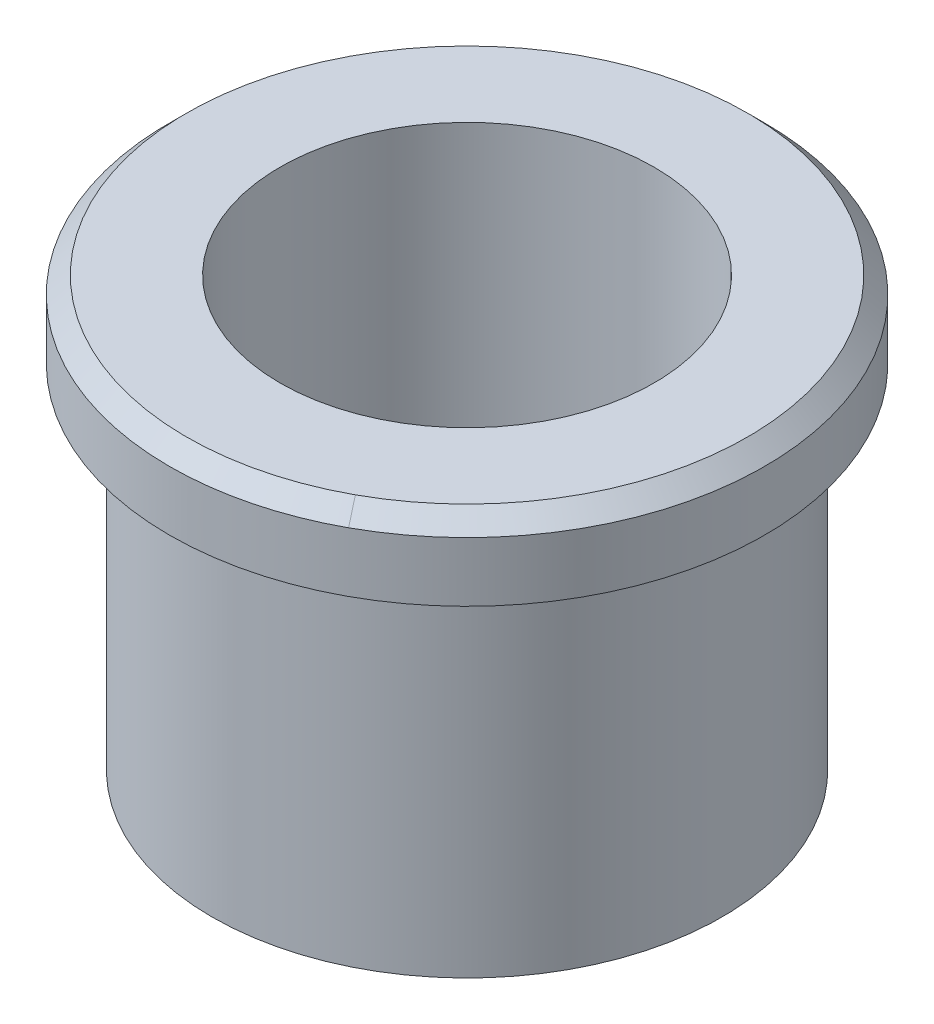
ISO-10303-21;
HEADER;
FILE_DESCRIPTION(('STEP AP214'),'2;1');
FILE_NAME('part.step','',(''),(''),'','','');
FILE_SCHEMA(('AUTOMOTIVE_DESIGN { 1 0 10303 214 1 1 1 1 }'));
ENDSEC;
DATA;
#1=APPLICATION_CONTEXT('core data for automotive mechanical design processes');
#2=APPLICATION_PROTOCOL_DEFINITION('international standard','automotive_design',2000,#1);
#3=PRODUCT_CONTEXT('',#1,'mechanical');
#4=PRODUCT('Part','Part','',(#3));
#5=PRODUCT_RELATED_PRODUCT_CATEGORY('part','',(#4));
#6=PRODUCT_DEFINITION_FORMATION('','',#4);
#7=PRODUCT_DEFINITION_CONTEXT('part definition',#1,'design');
#8=PRODUCT_DEFINITION('design','',#6,#7);
#9=PRODUCT_DEFINITION_SHAPE('','',#8);
#10=(LENGTH_UNIT() NAMED_UNIT(*) SI_UNIT(.MILLI.,.METRE.));
#11=(NAMED_UNIT(*) PLANE_ANGLE_UNIT() SI_UNIT($,.RADIAN.));
#12=(NAMED_UNIT(*) SI_UNIT($,.STERADIAN.) SOLID_ANGLE_UNIT());
#13=UNCERTAINTY_MEASURE_WITH_UNIT(LENGTH_MEASURE(1.E-05),#10,'distance_accuracy_value','');
#14=(GEOMETRIC_REPRESENTATION_CONTEXT(3) GLOBAL_UNCERTAINTY_ASSIGNED_CONTEXT((#13)) GLOBAL_UNIT_ASSIGNED_CONTEXT((#10,
#11,#12)) REPRESENTATION_CONTEXT('',''));
#15=CARTESIAN_POINT('',(0.,0.,0.));
#16=DIRECTION('',(0.,0.,1.));
#17=DIRECTION('',(1.,0.,0.));
#18=AXIS2_PLACEMENT_3D('',#15,#16,#17);
#19=CARTESIAN_POINT('',(0.,-12.75,0.));
#20=DIRECTION('',(0.,1.,0.));
#21=DIRECTION('',(0.,0.,1.));
#22=AXIS2_PLACEMENT_3D('',#19,#20,#21);
#23=CYLINDRICAL_SURFACE('',#22,11.);
#24=CARTESIAN_POINT('',(0.,0.,0.));
#25=DIRECTION('',(0.,1.,0.));
#26=DIRECTION('',(0.,0.,1.));
#27=AXIS2_PLACEMENT_3D('',#24,#25,#26);
#28=CIRCLE('',#27,11.);
#29=CARTESIAN_POINT('',(0.,0.,11.));
#30=VERTEX_POINT('',#29);
#31=EDGE_CURVE('E97',#30,#30,#28,.F.);
#32=ORIENTED_EDGE('',*,*,#31,.F.);
#33=EDGE_LOOP('',(#32));
#34=FACE_BOUND('',#33,.T.);
#35=CARTESIAN_POINT('',(0.,-25.2,0.));
#36=DIRECTION('',(0.,-1.,0.));
#37=DIRECTION('',(0.,0.,-1.));
#38=AXIS2_PLACEMENT_3D('',#35,#36,#37);
#39=CIRCLE('',#38,11.);
#40=CARTESIAN_POINT('',(0.,-25.2,-11.));
#41=VERTEX_POINT('',#40);
#42=EDGE_CURVE('E178',#41,#41,#39,.T.);
#43=ORIENTED_EDGE('',*,*,#42,.T.);
#44=EDGE_LOOP('',(#43));
#45=FACE_BOUND('',#44,.T.);
#46=ADVANCED_FACE('F30',(#34,#45),#23,.F.);
#47=CARTESIAN_POINT('',(0.,-12.75,0.));
#48=DIRECTION('',(0.,1.,0.));
#49=DIRECTION('',(0.,0.,1.));
#50=AXIS2_PLACEMENT_3D('',#47,#48,#49);
#51=CYLINDRICAL_SURFACE('',#50,15.);
#52=CARTESIAN_POINT('',(0.,-4.5,0.));
#53=DIRECTION('',(0.,1.,0.));
#54=DIRECTION('',(0.,0.,1.));
#55=AXIS2_PLACEMENT_3D('',#52,#53,#54);
#56=CIRCLE('',#55,15.);
#57=CARTESIAN_POINT('',(0.,-4.5,15.));
#58=VERTEX_POINT('',#57);
#59=EDGE_CURVE('E11',#58,#58,#56,.F.);
#60=ORIENTED_EDGE('',*,*,#59,.T.);
#61=EDGE_LOOP('',(#60));
#62=FACE_BOUND('',#61,.T.);
#63=CARTESIAN_POINT('',(0.,-25.2,0.));
#64=DIRECTION('',(0.,-1.,0.));
#65=DIRECTION('',(0.,0.,-1.));
#66=AXIS2_PLACEMENT_3D('',#63,#64,#65);
#67=CIRCLE('',#66,15.);
#68=CARTESIAN_POINT('',(0.,-25.2,-15.));
#69=VERTEX_POINT('',#68);
#70=EDGE_CURVE('E63',#69,#69,#67,.T.);
#71=ORIENTED_EDGE('',*,*,#70,.F.);
#72=EDGE_LOOP('',(#71));
#73=FACE_BOUND('',#72,.T.);
#74=ADVANCED_FACE('F32',(#62,#73),#51,.T.);
#75=CARTESIAN_POINT('',(0.,-1.00000000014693,0.));
#76=DIRECTION('',(0.,-1.,0.));
#77=DIRECTION('',(1.,0.,0.));
#78=AXIS2_PLACEMENT_3D('',#75,#76,#77);
#79=CONICAL_SURFACE('',#78,17.5000000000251,0.785398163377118);
#80=DIRECTION('',(-0.339005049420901,0.707106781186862,-0.620544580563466));
#81=VECTOR('',#80,1.);
#82=CARTESIAN_POINT('',(239241.254284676,-499000.,437928.178495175));
#83=LINE('',#82,#81);
#84=CARTESIAN_POINT('',(7.91052138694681,4.68652894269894E-11,14.480112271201));
#85=VERTEX_POINT('',#84);
#86=CARTESIAN_POINT('',(8.38994692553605,-0.999999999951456,15.357694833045));
#87=VERTEX_POINT('',#86);
#88=EDGE_CURVE('E56',#85,#87,#83,.F.);
#89=ORIENTED_EDGE('',*,*,#88,.F.);
#90=CARTESIAN_POINT('',(0.,0.,0.));
#91=DIRECTION('',(0.,-1.,0.));
#92=DIRECTION('',(1.,0.,0.));
#93=AXIS2_PLACEMENT_3D('',#90,#91,#92);
#94=CIRCLE('',#93,16.4999999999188);
#95=CARTESIAN_POINT('',(-7.91052085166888,2.84078316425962E-11,-14.4801125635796));
#96=VERTEX_POINT('',#95);
#97=EDGE_CURVE('E34',#96,#85,#94,.F.);
#98=ORIENTED_EDGE('',*,*,#97,.F.);
#99=CARTESIAN_POINT('',(-8.38994692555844,-0.999999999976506,-15.3576948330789));
#100=CARTESIAN_POINT('',(-8.36997083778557,-0.958333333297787,-15.321128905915));
#101=CARTESIAN_POINT('',(-8.34999475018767,-0.916666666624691,-15.2845629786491));
#102=CARTESIAN_POINT('',(-8.31004257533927,-0.833333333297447,-15.2114311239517));
#103=CARTESIAN_POINT('',(-8.29006648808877,-0.791666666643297,-15.1748651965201));
#104=CARTESIAN_POINT('',(-8.25011431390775,-0.70833333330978,-15.1017333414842));
#105=CARTESIAN_POINT('',(-8.23013822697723,-0.666666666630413,-15.0651674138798));
#106=CARTESIAN_POINT('',(-8.19018605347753,-0.583333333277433,-14.9920355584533));
#107=CARTESIAN_POINT('',(-8.17020996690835,-0.54166666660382,-14.9554696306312));
#108=CARTESIAN_POINT('',(-8.13025779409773,-0.458333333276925,-14.8823377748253));
#109=CARTESIAN_POINT('',(-8.1102817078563,-0.416666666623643,-14.8457718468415));
#110=CARTESIAN_POINT('',(-8.07032953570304,-0.333333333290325,-14.7726399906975));
#111=CARTESIAN_POINT('',(-8.05035344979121,-0.291666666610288,-14.7360740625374));
#112=CARTESIAN_POINT('',(-8.01040127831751,-0.208333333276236,-14.662942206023));
#113=CARTESIAN_POINT('',(-7.99042519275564,-0.166666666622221,-14.6263762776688));
#114=CARTESIAN_POINT('',(-7.95047302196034,-0.0833333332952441,-14.5532444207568));
#115=CARTESIAN_POINT('',(-7.93049693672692,-0.0416666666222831,-14.5166784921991));
#116=CARTESIAN_POINT('',(-7.9105208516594,5.67046409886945E-11,-14.4801125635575));
#117=B_SPLINE_CURVE_WITH_KNOTS('',3,(#99,#100,#101,#102,#103,#104,#105,#106,#107,#108,#109,#110,
#111,#112,#113,#114,#115,#116),.UNSPECIFIED.,.F.,.F.,(4,2,2,2,2,2,2,2,4),(0.,0.176776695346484,
0.353553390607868,0.530330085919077,0.707106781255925,0.883883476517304,1.06066017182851,
1.2374368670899,1.41421356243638),.UNSPECIFIED.);
#118=CARTESIAN_POINT('',(-8.38994692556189,-0.999999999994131,-15.3576948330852));
#119=VERTEX_POINT('',#118);
#120=EDGE_CURVE('E49',#119,#96,#117,.T.);
#121=ORIENTED_EDGE('',*,*,#120,.F.);
#122=CARTESIAN_POINT('',(0.,-1.,0.));
#123=DIRECTION('',(0.,1.,0.));
#124=DIRECTION('',(0.,0.,1.));
#125=AXIS2_PLACEMENT_3D('',#122,#123,#124);
#126=CIRCLE('',#125,17.5);
#127=EDGE_CURVE('E59',#87,#119,#126,.F.);
#128=ORIENTED_EDGE('',*,*,#127,.F.);
#129=EDGE_LOOP('',(#89,#98,#121,#128));
#130=FACE_BOUND('',#129,.T.);
#131=ADVANCED_FACE('F58',(#130),#79,.T.);
#132=CARTESIAN_POINT('',(0.,-0.999999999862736,0.));
#133=DIRECTION('',(0.,-1.,0.));
#134=DIRECTION('',(1.,0.,0.));
#135=AXIS2_PLACEMENT_3D('',#132,#133,#134);
#136=CONICAL_SURFACE('',#135,17.499999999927,0.785398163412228);
#137=ORIENTED_EDGE('',*,*,#120,.T.);
#138=CARTESIAN_POINT('',(0.,3.67622599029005E-11,0.));
#139=DIRECTION('',(0.,-1.,0.));
#140=DIRECTION('',(1.,0.,0.));
#141=AXIS2_PLACEMENT_3D('',#138,#139,#140);
#142=CIRCLE('',#141,16.4999999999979);
#143=EDGE_CURVE('E66',#85,#96,#142,.F.);
#144=ORIENTED_EDGE('',*,*,#143,.F.);
#145=ORIENTED_EDGE('',*,*,#88,.T.);
#146=CARTESIAN_POINT('',(0.,-1.,0.));
#147=DIRECTION('',(0.,1.,0.));
#148=DIRECTION('',(0.,0.,1.));
#149=AXIS2_PLACEMENT_3D('',#146,#147,#148);
#150=CIRCLE('',#149,17.5);
#151=EDGE_CURVE('E95',#119,#87,#150,.F.);
#152=ORIENTED_EDGE('',*,*,#151,.F.);
#153=EDGE_LOOP('',(#137,#144,#145,#152));
#154=FACE_BOUND('',#153,.T.);
#155=ADVANCED_FACE('F67',(#154),#136,.T.);
#156=CARTESIAN_POINT('',(0.,0.,11.));
#157=DIRECTION('',(0.,1.,0.));
#158=DIRECTION('',(0.,0.,1.));
#159=AXIS2_PLACEMENT_3D('',#156,#157,#158);
#160=PLANE('',#159);
#161=ORIENTED_EDGE('',*,*,#31,.T.);
#162=EDGE_LOOP('',(#161));
#163=FACE_BOUND('',#162,.T.);
#164=ORIENTED_EDGE('',*,*,#97,.T.);
#165=ORIENTED_EDGE('',*,*,#143,.T.);
#166=EDGE_LOOP('',(#164,#165));
#167=FACE_BOUND('',#166,.T.);
#168=ADVANCED_FACE('F69',(#163,#167),#160,.T.);
#169=CARTESIAN_POINT('',(0.,-12.75,0.));
#170=DIRECTION('',(0.,1.,0.));
#171=DIRECTION('',(0.,0.,1.));
#172=AXIS2_PLACEMENT_3D('',#169,#170,#171);
#173=CYLINDRICAL_SURFACE('',#172,17.5);
#174=CARTESIAN_POINT('',(0.,-4.5,0.));
#175=DIRECTION('',(0.,1.,0.));
#176=DIRECTION('',(0.,0.,1.));
#177=AXIS2_PLACEMENT_3D('',#174,#175,#176);
#178=CIRCLE('',#177,17.5);
#179=CARTESIAN_POINT('',(0.,-4.5,17.5));
#180=VERTEX_POINT('',#179);
#181=EDGE_CURVE('E40',#180,#180,#178,.T.);
#182=ORIENTED_EDGE('',*,*,#181,.T.);
#183=EDGE_LOOP('',(#182));
#184=FACE_BOUND('',#183,.T.);
#185=ORIENTED_EDGE('',*,*,#151,.T.);
#186=ORIENTED_EDGE('',*,*,#127,.T.);
#187=EDGE_LOOP('',(#185,#186));
#188=FACE_BOUND('',#187,.T.);
#189=ADVANCED_FACE('F108',(#184,#188),#173,.T.);
#190=CARTESIAN_POINT('',(0.,-4.5,17.5));
#191=DIRECTION('',(0.,1.,0.));
#192=DIRECTION('',(0.,0.,1.));
#193=AXIS2_PLACEMENT_3D('',#190,#191,#192);
#194=PLANE('',#193);
#195=ORIENTED_EDGE('',*,*,#59,.F.);
#196=EDGE_LOOP('',(#195));
#197=FACE_BOUND('',#196,.T.);
#198=ORIENTED_EDGE('',*,*,#181,.F.);
#199=EDGE_LOOP('',(#198));
#200=FACE_BOUND('',#199,.T.);
#201=ADVANCED_FACE('F110',(#197,#200),#194,.F.);
#202=CARTESIAN_POINT('',(0.,-25.2,0.));
#203=DIRECTION('',(0.,-1.,0.));
#204=DIRECTION('',(0.,0.,-1.));
#205=AXIS2_PLACEMENT_3D('',#202,#203,#204);
#206=PLANE('',#205);
#207=ORIENTED_EDGE('',*,*,#42,.F.);
#208=EDGE_LOOP('',(#207));
#209=FACE_BOUND('',#208,.T.);
#210=ORIENTED_EDGE('',*,*,#70,.T.);
#211=EDGE_LOOP('',(#210));
#212=FACE_BOUND('',#211,.T.);
#213=ADVANCED_FACE('F112',(#209,#212),#206,.T.);
#214=CLOSED_SHELL('',(#46,#74,#131,#155,#168,#189,#201,#213));
#215=MANIFOLD_SOLID_BREP('B2',#214);
#216=ADVANCED_BREP_SHAPE_REPRESENTATION('',(#18,#215),#14);
#217=SHAPE_DEFINITION_REPRESENTATION(#9,#216);
ENDSEC;
END-ISO-10303-21;
